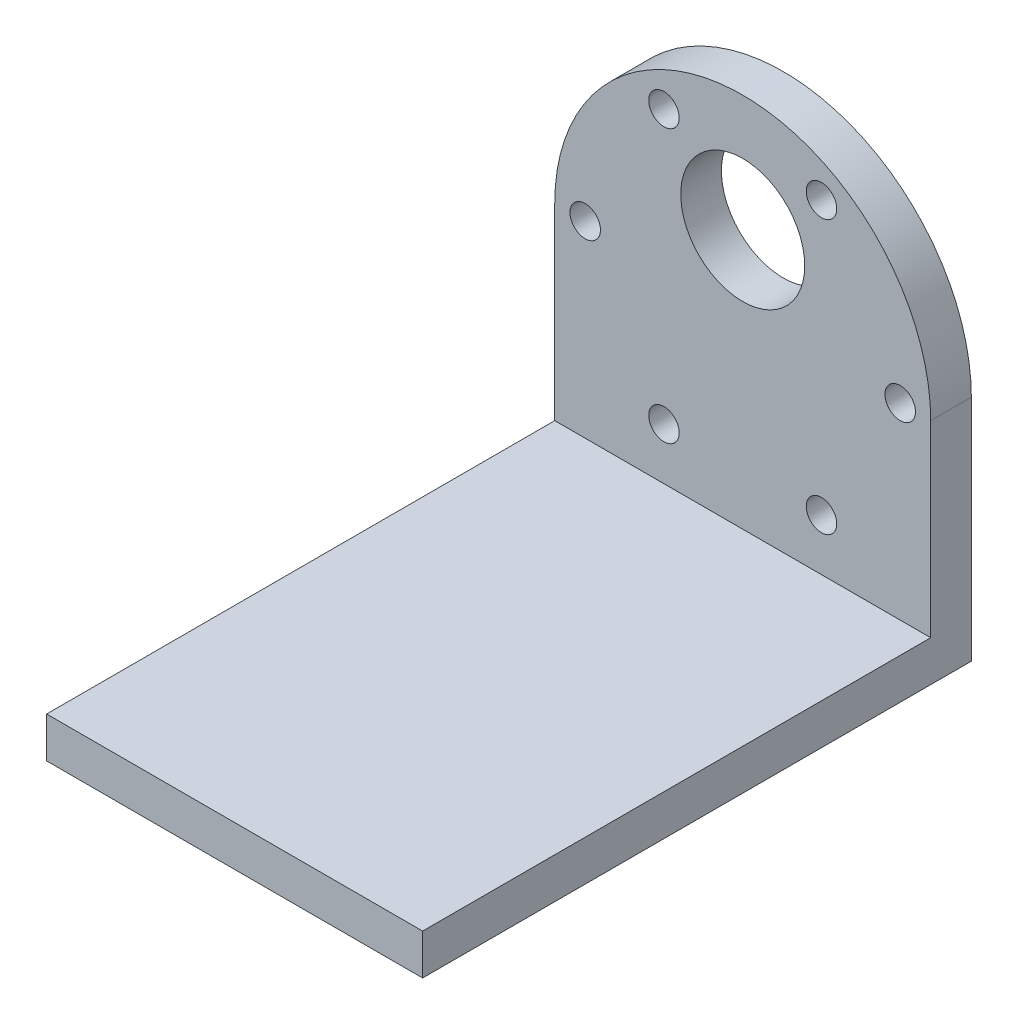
from build123d import *

# Parameters (mm, degrees)
ESQUISSE1_R        = 1.5
ESQUISSE1_R_2      = 6.1
BOSS_EXTRU_1_DEPTH = 4
ESQUISSE2_W        = 37
ESQUISSE2_H        = 4
BOSS_EXTRU_2_DEPTH = 50


with BuildPart() as part:
    # Esquisse1 → Boss.-Extru.1 (new body)
    with BuildSketch(Plane.XY):
        with BuildLine():
            Line((0, 22.5), (0, 0))
            Line((0, 0), (37, 0))
            Line((37, 0), (37, 22.5))
            ThreePointArc((37, 22.5), (18.5, 41), (0, 22.5))
        make_face()
        with Locations((3, 22.5)):
            Circle(ESQUISSE1_R, mode=Mode.SUBTRACT)
        with Locations((18.5, 29.5)):
            Circle(ESQUISSE1_R_2, mode=Mode.SUBTRACT)
        with Locations((10.75, 35.923393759)):
            Circle(ESQUISSE1_R, mode=Mode.SUBTRACT)
        with Locations((26.25, 35.923393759)):
            Circle(ESQUISSE1_R, mode=Mode.SUBTRACT)
        with Locations((34, 22.5)):
            Circle(ESQUISSE1_R, mode=Mode.SUBTRACT)
        with Locations((26.25, 9.076606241)):
            Circle(ESQUISSE1_R, mode=Mode.SUBTRACT)
        with Locations((10.75, 9.076606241)):
            Circle(ESQUISSE1_R, mode=Mode.SUBTRACT)
    extrude(amount=BOSS_EXTRU_1_DEPTH)

    # Esquisse2 → Boss.-Extru.2 (add)
    with BuildSketch(Plane.XY.offset(4)):
        with Locations((18.5, 2)):
            Rectangle(ESQUISSE2_W, ESQUISSE2_H)
    extrude(amount=BOSS_EXTRU_2_DEPTH)


solid = part.part
